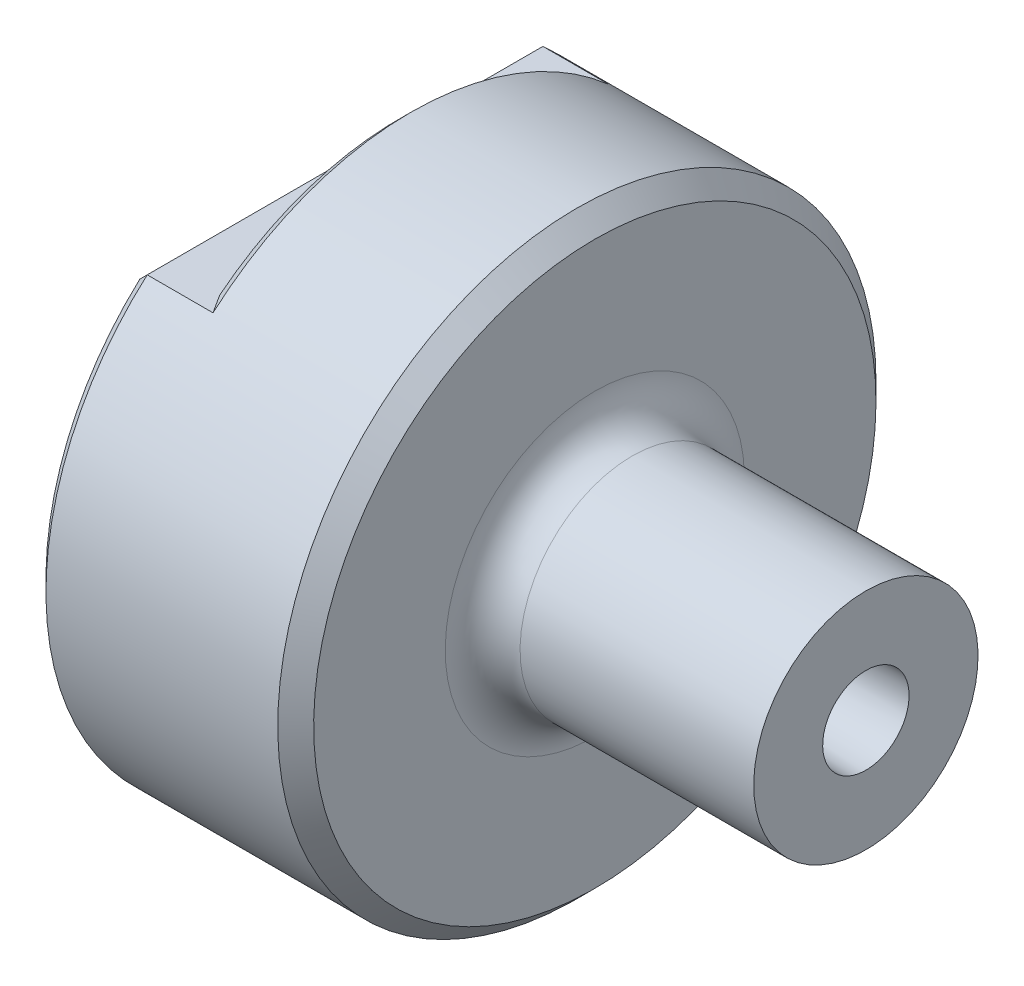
ISO-10303-21;
HEADER;
FILE_DESCRIPTION(('STEP AP214'),'2;1');
FILE_NAME('part.step','',(''),(''),'','','');
FILE_SCHEMA(('AUTOMOTIVE_DESIGN { 1 0 10303 214 1 1 1 1 }'));
ENDSEC;
DATA;
#1=APPLICATION_CONTEXT('core data for automotive mechanical design processes');
#2=APPLICATION_PROTOCOL_DEFINITION('international standard','automotive_design',2000,#1);
#3=PRODUCT_CONTEXT('',#1,'mechanical');
#4=PRODUCT('Part','Part','',(#3));
#5=PRODUCT_RELATED_PRODUCT_CATEGORY('part','',(#4));
#6=PRODUCT_DEFINITION_FORMATION('','',#4);
#7=PRODUCT_DEFINITION_CONTEXT('part definition',#1,'design');
#8=PRODUCT_DEFINITION('design','',#6,#7);
#9=PRODUCT_DEFINITION_SHAPE('','',#8);
#10=(LENGTH_UNIT() NAMED_UNIT(*) SI_UNIT(.MILLI.,.METRE.));
#11=(NAMED_UNIT(*) PLANE_ANGLE_UNIT() SI_UNIT($,.RADIAN.));
#12=(NAMED_UNIT(*) SI_UNIT($,.STERADIAN.) SOLID_ANGLE_UNIT());
#13=UNCERTAINTY_MEASURE_WITH_UNIT(LENGTH_MEASURE(1.E-05),#10,'distance_accuracy_value','');
#14=(GEOMETRIC_REPRESENTATION_CONTEXT(3) GLOBAL_UNCERTAINTY_ASSIGNED_CONTEXT((#13)) GLOBAL_UNIT_ASSIGNED_CONTEXT((#10,
#11,#12)) REPRESENTATION_CONTEXT('',''));
#15=CARTESIAN_POINT('',(0.,0.,0.));
#16=DIRECTION('',(0.,0.,1.));
#17=DIRECTION('',(1.,0.,0.));
#18=AXIS2_PLACEMENT_3D('',#15,#16,#17);
#19=CARTESIAN_POINT('',(22.621875,0.,0.));
#20=DIRECTION('',(1.,0.,0.));
#21=DIRECTION('',(0.,0.,-1.));
#22=AXIS2_PLACEMENT_3D('',#19,#20,#21);
#23=PLANE('',#22);
#24=CARTESIAN_POINT('',(22.621875,0.,0.));
#25=DIRECTION('',(1.,0.,0.));
#26=DIRECTION('',(0.,1.,0.));
#27=AXIS2_PLACEMENT_3D('',#24,#25,#26);
#28=CIRCLE('',#27,9.525);
#29=CARTESIAN_POINT('',(22.621875,9.525,0.));
#30=VERTEX_POINT('',#29);
#31=EDGE_CURVE('E101',#30,#30,#28,.T.);
#32=ORIENTED_EDGE('',*,*,#31,.T.);
#33=EDGE_LOOP('',(#32));
#34=FACE_BOUND('',#33,.T.);
#35=CARTESIAN_POINT('',(22.621875,0.,0.));
#36=DIRECTION('',(1.,0.,0.));
#37=DIRECTION('',(0.,1.,0.));
#38=AXIS2_PLACEMENT_3D('',#35,#36,#37);
#39=CIRCLE('',#38,3.66892116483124);
#40=CARTESIAN_POINT('',(22.621875,3.66892116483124,0.));
#41=VERTEX_POINT('',#40);
#42=EDGE_CURVE('E157',#41,#41,#39,.T.);
#43=ORIENTED_EDGE('',*,*,#42,.F.);
#44=EDGE_LOOP('',(#43));
#45=FACE_BOUND('',#44,.T.);
#46=ADVANCED_FACE('F32',(#34,#45),#23,.T.);
#47=CARTESIAN_POINT('',(-22.621875,0.,0.));
#48=DIRECTION('',(1.,0.,0.));
#49=DIRECTION('',(0.,0.,-1.));
#50=AXIS2_PLACEMENT_3D('',#47,#48,#49);
#51=PLANE('',#50);
#52=CARTESIAN_POINT('',(-22.621875,0.,0.));
#53=DIRECTION('',(1.,0.,0.));
#54=DIRECTION('',(0.,0.,-1.));
#55=AXIS2_PLACEMENT_3D('',#52,#53,#54);
#56=CIRCLE('',#55,24.384);
#57=CARTESIAN_POINT('',(-22.621875,18.034,-16.4120169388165));
#58=VERTEX_POINT('',#57);
#59=CARTESIAN_POINT('',(-22.621875,18.034,16.4120169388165));
#60=VERTEX_POINT('',#59);
#61=EDGE_CURVE('E52',#58,#60,#56,.F.);
#62=ORIENTED_EDGE('',*,*,#61,.T.);
#63=DIRECTION('',(0.,0.,-1.));
#64=VECTOR('',#63,1.);
#65=CARTESIAN_POINT('',(-22.621875,18.034,0.));
#66=LINE('',#65,#64);
#67=EDGE_CURVE('E126',#60,#58,#66,.T.);
#68=ORIENTED_EDGE('',*,*,#67,.T.);
#69=EDGE_LOOP('',(#62,#68));
#70=FACE_BOUND('',#69,.T.);
#71=CARTESIAN_POINT('',(-22.621875,0.,0.));
#72=DIRECTION('',(1.,0.,0.));
#73=DIRECTION('',(0.,1.,0.));
#74=AXIS2_PLACEMENT_3D('',#71,#72,#73);
#75=CIRCLE('',#74,12.4401929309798);
#76=CARTESIAN_POINT('',(-22.621875,12.4401929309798,0.));
#77=VERTEX_POINT('',#76);
#78=EDGE_CURVE('E106',#77,#77,#75,.T.);
#79=ORIENTED_EDGE('',*,*,#78,.T.);
#80=EDGE_LOOP('',(#79));
#81=FACE_BOUND('',#80,.T.);
#82=ADVANCED_FACE('F166',(#70,#81),#51,.F.);
#83=CARTESIAN_POINT('',(22.621875,0.,0.));
#84=DIRECTION('',(-1.,0.,0.));
#85=DIRECTION('',(0.,0.,1.));
#86=AXIS2_PLACEMENT_3D('',#83,#84,#85);
#87=CYLINDRICAL_SURFACE('',#86,25.4);
#88=CARTESIAN_POINT('',(-1.92087500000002,0.,0.));
#89=DIRECTION('',(1.,0.,0.));
#90=DIRECTION('',(0.,0.,-1.));
#91=AXIS2_PLACEMENT_3D('',#88,#89,#90);
#92=CIRCLE('',#91,25.4);
#93=CARTESIAN_POINT('',(-1.92087500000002,0.,-25.4));
#94=VERTEX_POINT('',#93);
#95=EDGE_CURVE('E97',#94,#94,#92,.F.);
#96=ORIENTED_EDGE('',*,*,#95,.T.);
#97=EDGE_LOOP('',(#96));
#98=FACE_BOUND('',#97,.T.);
#99=DIRECTION('',(-1.,0.,0.));
#100=VECTOR('',#99,1.);
#101=CARTESIAN_POINT('',(22.621875,19.05,-16.8005208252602));
#102=LINE('',#101,#100);
#103=CARTESIAN_POINT('',(-21.605875,19.05,-16.8005208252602));
#104=VERTEX_POINT('',#103);
#105=CARTESIAN_POINT('',(-16.017875,19.05,-16.8005208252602));
#106=VERTEX_POINT('',#105);
#107=EDGE_CURVE('E100',#104,#106,#102,.F.);
#108=ORIENTED_EDGE('',*,*,#107,.T.);
#109=CARTESIAN_POINT('',(-16.017875,0.,0.));
#110=DIRECTION('',(-1.,0.,0.));
#111=DIRECTION('',(0.,0.,1.));
#112=AXIS2_PLACEMENT_3D('',#109,#110,#111);
#113=CIRCLE('',#112,25.4);
#114=CARTESIAN_POINT('',(-16.017875,19.05,16.8005208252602));
#115=VERTEX_POINT('',#114);
#116=EDGE_CURVE('E86',#106,#115,#113,.F.);
#117=ORIENTED_EDGE('',*,*,#116,.T.);
#118=DIRECTION('',(-1.,0.,0.));
#119=VECTOR('',#118,1.);
#120=CARTESIAN_POINT('',(22.621875,19.05,16.8005208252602));
#121=LINE('',#120,#119);
#122=CARTESIAN_POINT('',(-21.605875,19.05,16.8005208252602));
#123=VERTEX_POINT('',#122);
#124=EDGE_CURVE('E103',#115,#123,#121,.T.);
#125=ORIENTED_EDGE('',*,*,#124,.T.);
#126=CARTESIAN_POINT('',(-21.605875,0.,0.));
#127=DIRECTION('',(1.,0.,0.));
#128=DIRECTION('',(0.,0.,-1.));
#129=AXIS2_PLACEMENT_3D('',#126,#127,#128);
#130=CIRCLE('',#129,25.4);
#131=EDGE_CURVE('E96',#123,#104,#130,.T.);
#132=ORIENTED_EDGE('',*,*,#131,.T.);
#133=EDGE_LOOP('',(#108,#117,#125,#132));
#134=FACE_BOUND('',#133,.T.);
#135=ADVANCED_FACE('F188',(#98,#134),#87,.T.);
#136=CARTESIAN_POINT('',(-17.033875,0.,0.));
#137=DIRECTION('',(-1.,0.,0.));
#138=DIRECTION('',(0.,0.,1.));
#139=AXIS2_PLACEMENT_3D('',#136,#137,#138);
#140=PLANE('',#139);
#141=DIRECTION('',(0.,0.,1.));
#142=VECTOR('',#141,1.);
#143=CARTESIAN_POINT('',(-17.033875,19.05,-25.4));
#144=LINE('',#143,#142);
#145=CARTESIAN_POINT('',(-17.033875,19.05,-15.2209380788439));
#146=VERTEX_POINT('',#145);
#147=CARTESIAN_POINT('',(-17.033875,19.05,15.2209380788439));
#148=VERTEX_POINT('',#147);
#149=EDGE_CURVE('E95',#146,#148,#144,.T.);
#150=ORIENTED_EDGE('',*,*,#149,.T.);
#151=CARTESIAN_POINT('',(-17.033875,0.,0.));
#152=DIRECTION('',(-1.,0.,0.));
#153=DIRECTION('',(0.,0.,1.));
#154=AXIS2_PLACEMENT_3D('',#151,#152,#153);
#155=CIRCLE('',#154,24.384);
#156=EDGE_CURVE('E84',#148,#146,#155,.T.);
#157=ORIENTED_EDGE('',*,*,#156,.T.);
#158=EDGE_LOOP('',(#150,#157));
#159=FACE_BOUND('',#158,.T.);
#160=ADVANCED_FACE('F94',(#159),#140,.T.);
#161=CARTESIAN_POINT('',(-17.033875,19.05,-25.4));
#162=DIRECTION('',(0.,-1.,0.));
#163=DIRECTION('',(0.,0.,-1.));
#164=AXIS2_PLACEMENT_3D('',#161,#162,#163);
#165=PLANE('',#164);
#166=ORIENTED_EDGE('',*,*,#107,.F.);
#167=DIRECTION('',(0.,0.,1.));
#168=VECTOR('',#167,1.);
#169=CARTESIAN_POINT('',(-21.605875,19.05,-25.4));
#170=LINE('',#169,#168);
#171=EDGE_CURVE('E90',#104,#123,#170,.T.);
#172=ORIENTED_EDGE('',*,*,#171,.T.);
#173=ORIENTED_EDGE('',*,*,#124,.F.);
#174=CARTESIAN_POINT('',(-16.017875,19.05,16.8005208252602));
#175=CARTESIAN_POINT('',(-16.1042219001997,19.05,16.6699759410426));
#176=CARTESIAN_POINT('',(-16.190175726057,19.05,16.5391707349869));
#177=CARTESIAN_POINT('',(-16.3612541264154,19.05,16.2770272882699));
#178=CARTESIAN_POINT('',(-16.4463787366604,19.05,16.1456890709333));
#179=CARTESIAN_POINT('',(-16.6157633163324,19.05,15.8824555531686));
#180=CARTESIAN_POINT('',(-16.7000232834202,19.05,15.7505602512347));
#181=CARTESIAN_POINT('',(-16.8676390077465,19.05,15.4861884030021));
#182=CARTESIAN_POINT('',(-16.9509947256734,19.05,15.3537118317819));
#183=CARTESIAN_POINT('',(-17.033875,19.05,15.2209380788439));
#184=B_SPLINE_CURVE_WITH_KNOTS('',3,(#174,#175,#176,#177,#178,#179,#180,#181,#182,#183),
.UNSPECIFIED.,.F.,.F.,(4,2,2,2,4),(0.,0.469552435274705,0.939084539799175,1.40861791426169,
1.87817162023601),.UNSPECIFIED.);
#185=EDGE_CURVE('E11',#115,#148,#184,.T.);
#186=ORIENTED_EDGE('',*,*,#185,.T.);
#187=ORIENTED_EDGE('',*,*,#149,.F.);
#188=CARTESIAN_POINT('',(-17.033875,19.05,-15.2209380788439));
#189=CARTESIAN_POINT('',(-16.9509947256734,19.05,-15.3537118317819));
#190=CARTESIAN_POINT('',(-16.8676390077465,19.05,-15.4861884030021));
#191=CARTESIAN_POINT('',(-16.7000232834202,19.05,-15.7505602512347));
#192=CARTESIAN_POINT('',(-16.6157633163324,19.05,-15.8824555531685));
#193=CARTESIAN_POINT('',(-16.4463787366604,19.05,-16.1456890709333));
#194=CARTESIAN_POINT('',(-16.3612541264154,19.05,-16.2770272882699));
#195=CARTESIAN_POINT('',(-16.190175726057,19.05,-16.5391707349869));
#196=CARTESIAN_POINT('',(-16.1042219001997,19.05,-16.6699759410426));
#197=CARTESIAN_POINT('',(-16.017875,19.05,-16.8005208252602));
#198=B_SPLINE_CURVE_WITH_KNOTS('',3,(#188,#189,#190,#191,#192,#193,#194,#195,#196,#197),
.UNSPECIFIED.,.F.,.F.,(4,2,2,2,4),(0.,0.469553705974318,0.939087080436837,1.40861918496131,
1.87817162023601),.UNSPECIFIED.);
#199=EDGE_CURVE('E45',#146,#106,#198,.T.);
#200=ORIENTED_EDGE('',*,*,#199,.T.);
#201=EDGE_LOOP('',(#166,#172,#173,#186,#187,#200));
#202=FACE_BOUND('',#201,.T.);
#203=ADVANCED_FACE('F99',(#202),#165,.F.);
#204=CARTESIAN_POINT('',(-0.396875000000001,-25.4,0.));
#205=DIRECTION('',(1.,0.,0.));
#206=DIRECTION('',(0.,1.,0.));
#207=AXIS2_PLACEMENT_3D('',#204,#205,#206);
#208=PLANE('',#207);
#209=CARTESIAN_POINT('',(-0.396875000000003,0.,0.));
#210=DIRECTION('',(1.,0.,0.));
#211=DIRECTION('',(0.,1.,0.));
#212=AXIS2_PLACEMENT_3D('',#209,#210,#211);
#213=CIRCLE('',#212,23.876);
#214=CARTESIAN_POINT('',(-0.396875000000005,23.876,0.));
#215=VERTEX_POINT('',#214);
#216=EDGE_CURVE('E118',#215,#215,#213,.T.);
#217=ORIENTED_EDGE('',*,*,#216,.T.);
#218=EDGE_LOOP('',(#217));
#219=FACE_BOUND('',#218,.T.);
#220=CARTESIAN_POINT('',(-0.396875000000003,0.,0.));
#221=DIRECTION('',(1.,0.,0.));
#222=DIRECTION('',(0.,1.,0.));
#223=AXIS2_PLACEMENT_3D('',#220,#221,#222);
#224=CIRCLE('',#223,12.7);
#225=CARTESIAN_POINT('',(-0.396875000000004,12.7,0.));
#226=VERTEX_POINT('',#225);
#227=EDGE_CURVE('E115',#226,#226,#224,.F.);
#228=ORIENTED_EDGE('',*,*,#227,.T.);
#229=EDGE_LOOP('',(#228));
#230=FACE_BOUND('',#229,.T.);
#231=ADVANCED_FACE('F180',(#219,#230),#208,.T.);
#232=CARTESIAN_POINT('',(22.621875,0.,0.));
#233=DIRECTION('',(1.,0.,0.));
#234=DIRECTION('',(0.,1.,0.));
#235=AXIS2_PLACEMENT_3D('',#232,#233,#234);
#236=CYLINDRICAL_SURFACE('',#235,9.525);
#237=CARTESIAN_POINT('',(2.778125,0.,0.));
#238=DIRECTION('',(1.,0.,0.));
#239=DIRECTION('',(0.,1.,0.));
#240=AXIS2_PLACEMENT_3D('',#237,#238,#239);
#241=CIRCLE('',#240,9.525);
#242=CARTESIAN_POINT('',(2.77812499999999,9.525,0.));
#243=VERTEX_POINT('',#242);
#244=EDGE_CURVE('E112',#243,#243,#241,.T.);
#245=ORIENTED_EDGE('',*,*,#244,.T.);
#246=EDGE_LOOP('',(#245));
#247=FACE_BOUND('',#246,.T.);
#248=ORIENTED_EDGE('',*,*,#31,.F.);
#249=EDGE_LOOP('',(#248));
#250=FACE_BOUND('',#249,.T.);
#251=ADVANCED_FACE('F171',(#247,#250),#236,.T.);
#252=CARTESIAN_POINT('',(-37.049075,0.,0.));
#253=DIRECTION('',(1.,0.,0.));
#254=DIRECTION('',(0.,1.,0.));
#255=AXIS2_PLACEMENT_3D('',#252,#253,#254);
#256=SPHERICAL_SURFACE('',#255,19.05);
#257=CARTESIAN_POINT('',(-18.2027352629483,0.,0.));
#258=DIRECTION('',(1.,0.,0.));
#259=DIRECTION('',(0.,1.,0.));
#260=AXIS2_PLACEMENT_3D('',#257,#258,#259);
#261=CIRCLE('',#260,2.778125);
#262=CARTESIAN_POINT('',(-18.2027352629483,2.77812499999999,0.));
#263=VERTEX_POINT('',#262);
#264=EDGE_CURVE('E154',#263,#263,#261,.T.);
#265=CARTESIAN_POINT('',(-18.2027352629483,2.77812499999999,0.));
#266=CARTESIAN_POINT('',(-18.2190919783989,2.88908700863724,0.));
#267=CARTESIAN_POINT('',(-18.236428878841,2.99990452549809,0.));
#268=CARTESIAN_POINT('',(-18.2730571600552,3.2212160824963,0.));
#269=CARTESIAN_POINT('',(-18.2923485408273,3.33171012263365,0.));
#270=CARTESIAN_POINT('',(-18.3328798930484,3.55234023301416,0.));
#271=CARTESIAN_POINT('',(-18.3541198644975,3.66247630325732,0.));
#272=CARTESIAN_POINT('',(-18.3985417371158,3.88235611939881,0.));
#273=CARTESIAN_POINT('',(-18.4217236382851,3.99209986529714,0.));
#274=CARTESIAN_POINT('',(-18.4700221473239,4.21116079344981,0.));
#275=CARTESIAN_POINT('',(-18.4951387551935,4.32047797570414,0.));
#276=CARTESIAN_POINT('',(-18.5472988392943,4.53865167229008,0.));
#277=CARTESIAN_POINT('',(-18.5743423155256,4.64750818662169,0.));
#278=CARTESIAN_POINT('',(-18.6303477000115,4.86472658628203,0.));
#279=CARTESIAN_POINT('',(-18.6593096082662,4.97308847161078,0.));
#280=CARTESIAN_POINT('',(-18.7191428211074,5.18928380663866,0.));
#281=CARTESIAN_POINT('',(-18.750014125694,5.29711725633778,0.));
#282=CARTESIAN_POINT('',(-18.8136565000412,5.51222207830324,0.));
#283=CARTESIAN_POINT('',(-18.8464275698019,5.61949345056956,0.));
#284=CARTESIAN_POINT('',(-18.913859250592,5.83344065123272,0.));
#285=CARTESIAN_POINT('',(-18.9485198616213,5.94011647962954,0.));
#286=CARTESIAN_POINT('',(-19.0197198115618,6.15283931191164,0.));
#287=CARTESIAN_POINT('',(-19.0562591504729,6.25888631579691,0.));
#288=CARTESIAN_POINT('',(-19.1312051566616,6.47031841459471,0.));
#289=CARTESIAN_POINT('',(-19.1696118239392,6.57570350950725,0.));
#290=CARTESIAN_POINT('',(-19.248280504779,6.78577891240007,0.));
#291=CARTESIAN_POINT('',(-19.2885425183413,6.89046922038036,0.));
#292=CARTESIAN_POINT('',(-19.3709093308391,7.09912238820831,0.));
#293=CARTESIAN_POINT('',(-19.4130141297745,7.20308524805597,0.));
#294=CARTESIAN_POINT('',(-19.4990533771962,7.41025108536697,0.));
#295=CARTESIAN_POINT('',(-19.5429878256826,7.5134540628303,0.));
#296=CARTESIAN_POINT('',(-19.6326726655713,7.71906793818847,0.));
#297=CARTESIAN_POINT('',(-19.6784230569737,7.8214788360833,0.));
#298=CARTESIAN_POINT('',(-19.7717255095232,8.02547660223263,0.));
#299=CARTESIAN_POINT('',(-19.8192775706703,8.12706347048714,0.));
#300=CARTESIAN_POINT('',(-19.9161685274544,8.32938148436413,0.));
#301=CARTESIAN_POINT('',(-19.9655074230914,8.43011262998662,0.));
#302=CARTESIAN_POINT('',(-20.0659566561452,8.63068777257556,0.));
#303=CARTESIAN_POINT('',(-20.117066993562,8.73053176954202,0.));
#304=CARTESIAN_POINT('',(-20.2210431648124,8.92930146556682,0.));
#305=CARTESIAN_POINT('',(-20.2739089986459,9.02822716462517,0.));
#306=CARTESIAN_POINT('',(-20.3813796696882,9.22512940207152,0.));
#307=CARTESIAN_POINT('',(-20.4359845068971,9.32310594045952,0.));
#308=CARTESIAN_POINT('',(-20.5469161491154,9.51807928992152,0.));
#309=CARTESIAN_POINT('',(-20.6032429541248,9.61507610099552,0.));
#310=CARTESIAN_POINT('',(-20.7176009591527,9.80805973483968,0.));
#311=CARTESIAN_POINT('',(-20.775632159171,9.90404655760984,0.));
#312=CARTESIAN_POINT('',(-20.8933808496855,10.0949802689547,0.));
#313=CARTESIAN_POINT('',(-20.9530983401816,10.1899271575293,0.));
#314=CARTESIAN_POINT('',(-21.0742009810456,10.3787513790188,0.));
#315=CARTESIAN_POINT('',(-21.1355861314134,10.4726287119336,0.));
#316=CARTESIAN_POINT('',(-21.2600049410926,10.6592845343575,0.));
#317=CARTESIAN_POINT('',(-21.3230386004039,10.7520630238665,0.));
#318=CARTESIAN_POINT('',(-21.4507347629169,10.9364922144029,0.));
#319=CARTESIAN_POINT('',(-21.5153972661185,11.0281429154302,0.));
#320=CARTESIAN_POINT('',(-21.6463309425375,11.2102879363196,0.));
#321=CARTESIAN_POINT('',(-21.7126021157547,11.3007822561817,0.));
#322=CARTESIAN_POINT('',(-21.8467324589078,11.4805862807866,0.));
#323=CARTESIAN_POINT('',(-21.9145916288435,11.5698959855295,0.));
#324=CARTESIAN_POINT('',(-22.0518767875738,11.7473029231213,0.));
#325=CARTESIAN_POINT('',(-22.1213027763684,11.8354001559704,0.));
#326=CARTESIAN_POINT('',(-22.2616999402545,12.0103546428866,0.));
#327=CARTESIAN_POINT('',(-22.332671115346,12.0972118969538,0.));
#328=CARTESIAN_POINT('',(-22.4761364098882,12.2696594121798,0.));
#329=CARTESIAN_POINT('',(-22.5486305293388,12.3552496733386,0.));
#330=CARTESIAN_POINT('',(-22.621875,12.4401929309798,0.));
#331=B_SPLINE_CURVE_WITH_KNOTS('',3,(#265,#266,#267,#268,#269,#270,#271,#272,#273,#274,#275,
#276,#277,#278,#279,#280,#281,#282,#283,#284,#285,#286,#287,#288,#289,#290,#291,#292,#293,#294,
#295,#296,#297,#298,#299,#300,#301,#302,#303,#304,#305,#306,#307,#308,#309,#310,#311,#312,#313,
#314,#315,#316,#317,#318,#319,#320,#321,#322,#323,#324,#325,#326,#327,#328,#329,#330),
.UNSPECIFIED.,.F.,.F.,(4,2,2,2,2,2,2,2,2,2,2,2,2,2,2,2,2,2,2,2,2,2,2,2,2,2,2,2,2,2,2,2,4),(0.,
0.336478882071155,0.672957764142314,1.00943664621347,1.34591552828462,1.68239441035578,
2.01887329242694,2.35535217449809,2.69183105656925,3.02830993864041,3.36478882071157,
3.70126770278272,4.03774658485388,4.37422546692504,4.71070434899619,5.04718323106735,
5.38366211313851,5.72014099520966,6.05661987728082,6.39309875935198,6.72957764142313,
7.06605652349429,7.40253540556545,7.7390142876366,8.07549316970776,8.41197205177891,
8.74845093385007,9.08492981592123,9.42140869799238,9.75788758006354,10.0943664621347,
10.4308453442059,10.767324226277),.UNSPECIFIED.);
#332=EDGE_CURVE('BSEAM168',#263,#77,#331,.T.);
#333=ORIENTED_EDGE('',*,*,#264,.T.);
#334=ORIENTED_EDGE('',*,*,#78,.F.);
#335=ORIENTED_EDGE('',*,*,#332,.T.);
#336=ORIENTED_EDGE('',*,*,#332,.F.);
#337=EDGE_LOOP('',(#333,#335,#334,#336));
#338=FACE_BOUND('',#337,.T.);
#339=ADVANCED_FACE('F168',(#338),#256,.F.);
#340=CARTESIAN_POINT('',(-18.2027352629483,0.,0.));
#341=DIRECTION('',(1.,0.,0.));
#342=DIRECTION('',(0.,1.,0.));
#343=AXIS2_PLACEMENT_3D('',#340,#341,#342);
#344=CONICAL_SURFACE('',#343,2.778125,0.0218166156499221);
#345=ORIENTED_EDGE('',*,*,#42,.T.);
#346=EDGE_LOOP('',(#345));
#347=FACE_BOUND('',#346,.T.);
#348=ORIENTED_EDGE('',*,*,#264,.F.);
#349=EDGE_LOOP('',(#348));
#350=FACE_BOUND('',#349,.T.);
#351=ADVANCED_FACE('F170',(#347,#350),#344,.F.);
#352=CARTESIAN_POINT('',(2.778125,0.,0.));
#353=DIRECTION('',(1.,0.,0.));
#354=DIRECTION('',(0.,1.,0.));
#355=AXIS2_PLACEMENT_3D('',#352,#353,#354);
#356=TOROIDAL_SURFACE('',#355,12.7,3.175);
#357=ORIENTED_EDGE('',*,*,#227,.F.);
#358=EDGE_LOOP('',(#357));
#359=FACE_BOUND('',#358,.T.);
#360=ORIENTED_EDGE('',*,*,#244,.F.);
#361=EDGE_LOOP('',(#360));
#362=FACE_BOUND('',#361,.T.);
#363=ADVANCED_FACE('F177',(#359,#362),#356,.F.);
#364=CARTESIAN_POINT('',(-0.396875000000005,0.,0.));
#365=DIRECTION('',(-1.,0.,0.));
#366=DIRECTION('',(0.,0.,1.));
#367=AXIS2_PLACEMENT_3D('',#364,#365,#366);
#368=CONICAL_SURFACE('',#367,23.876,0.785398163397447);
#369=ORIENTED_EDGE('',*,*,#95,.F.);
#370=EDGE_LOOP('',(#369));
#371=FACE_BOUND('',#370,.T.);
#372=ORIENTED_EDGE('',*,*,#216,.F.);
#373=EDGE_LOOP('',(#372));
#374=FACE_BOUND('',#373,.T.);
#375=ADVANCED_FACE('F144',(#371,#374),#368,.T.);
#376=CARTESIAN_POINT('',(-17.033875,0.,0.));
#377=DIRECTION('',(1.,0.,0.));
#378=DIRECTION('',(0.,0.,-1.));
#379=AXIS2_PLACEMENT_3D('',#376,#377,#378);
#380=CONICAL_SURFACE('',#379,24.384,0.785398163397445);
#381=ORIENTED_EDGE('',*,*,#185,.F.);
#382=ORIENTED_EDGE('',*,*,#116,.F.);
#383=ORIENTED_EDGE('',*,*,#199,.F.);
#384=ORIENTED_EDGE('',*,*,#156,.F.);
#385=EDGE_LOOP('',(#381,#382,#383,#384));
#386=FACE_BOUND('',#385,.T.);
#387=ADVANCED_FACE('F83',(#386),#380,.T.);
#388=CARTESIAN_POINT('',(-21.605875,0.,0.));
#389=DIRECTION('',(1.,0.,0.));
#390=DIRECTION('',(0.,0.,-1.));
#391=AXIS2_PLACEMENT_3D('',#388,#389,#390);
#392=CONICAL_SURFACE('',#391,25.4,0.785398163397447);
#393=CARTESIAN_POINT('',(-22.621875,18.034,-16.4120169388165));
#394=CARTESIAN_POINT('',(-22.452676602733,18.203198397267,-16.4774733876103));
#395=CARTESIAN_POINT('',(-22.2834107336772,18.3724642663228,-16.5425769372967));
#396=CARTESIAN_POINT('',(-21.9447440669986,18.7111309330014,-16.6720782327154));
#397=CARTESIAN_POINT('',(-21.7753432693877,18.8805317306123,-16.7364759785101));
#398=CARTESIAN_POINT('',(-21.605875,19.05,-16.8005208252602));
#399=B_SPLINE_CURVE_WITH_KNOTS('',3,(#393,#394,#395,#396,#397,#398),.UNSPECIFIED.,.F.,.F.,(4,2,
4),(0.,0.744219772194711,1.4884394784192),.UNSPECIFIED.);
#400=EDGE_CURVE('E60',#104,#58,#399,.F.);
#401=ORIENTED_EDGE('',*,*,#400,.F.);
#402=ORIENTED_EDGE('',*,*,#131,.F.);
#403=CARTESIAN_POINT('',(-21.605875,19.05,16.8005208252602));
#404=CARTESIAN_POINT('',(-21.7753432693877,18.8805317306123,16.7364759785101));
#405=CARTESIAN_POINT('',(-21.9447440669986,18.7111309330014,16.6720782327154));
#406=CARTESIAN_POINT('',(-22.2834107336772,18.3724642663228,16.5425769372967));
#407=CARTESIAN_POINT('',(-22.452676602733,18.203198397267,16.4774733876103));
#408=CARTESIAN_POINT('',(-22.621875,18.034,16.4120169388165));
#409=B_SPLINE_CURVE_WITH_KNOTS('',3,(#403,#404,#405,#406,#407,#408),.UNSPECIFIED.,.F.,.F.,(4,2,
4),(0.,0.744219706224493,1.4884394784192),.UNSPECIFIED.);
#410=EDGE_CURVE('E37',#60,#123,#409,.F.);
#411=ORIENTED_EDGE('',*,*,#410,.F.);
#412=ORIENTED_EDGE('',*,*,#61,.F.);
#413=EDGE_LOOP('',(#401,#402,#411,#412));
#414=FACE_BOUND('',#413,.T.);
#415=ADVANCED_FACE('F143',(#414),#392,.T.);
#416=CARTESIAN_POINT('',(-22.621875,18.034,0.));
#417=DIRECTION('',(0.707106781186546,-0.707106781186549,0.));
#418=DIRECTION('',(0.,0.,-1.));
#419=AXIS2_PLACEMENT_3D('',#416,#417,#418);
#420=PLANE('',#419);
#421=ORIENTED_EDGE('',*,*,#410,.T.);
#422=ORIENTED_EDGE('',*,*,#171,.F.);
#423=ORIENTED_EDGE('',*,*,#400,.T.);
#424=ORIENTED_EDGE('',*,*,#67,.F.);
#425=EDGE_LOOP('',(#421,#422,#423,#424));
#426=FACE_BOUND('',#425,.T.);
#427=ADVANCED_FACE('F34',(#426),#420,.F.);
#428=CLOSED_SHELL('',(#46,#82,#135,#160,#203,#231,#251,#339,#351,#363,#375,#387,#415,#427));
#429=MANIFOLD_SOLID_BREP('B2',#428);
#430=ADVANCED_BREP_SHAPE_REPRESENTATION('',(#18,#429),#14);
#431=SHAPE_DEFINITION_REPRESENTATION(#9,#430);
ENDSEC;
END-ISO-10303-21;
